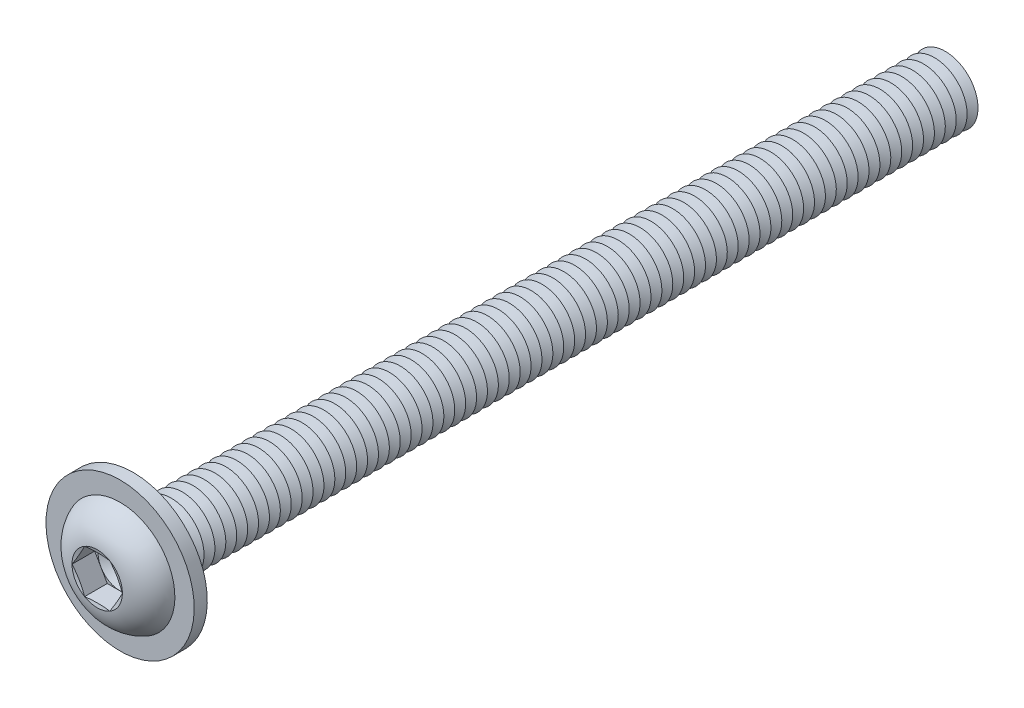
from build123d import *

# Parameters (mm, degrees)
FILLET1_R           = 0.5
LPATTERN1_COUNT     = 75
LPATTERN1_PITCH     = 1
CUT_EXTRUDE1_DEPTH  = 2.08
SKETCH5_R           = 6.8
SKETCH5_R_2         = 3.5
BOSS_EXTRUDE1_DEPTH = 1.2


with BuildPart() as part:
    # Sketch1 → Revolve1 (revolve)
    with BuildSketch(Plane(origin=(0, 0, 0), x_dir=(0, 0, -1), z_dir=(1, 0, 0))):
        with BuildLine():
            Line((0, 3), (0, 5.25))
            ThreePointArc((0, 5.25), (-2.210041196, 4.408189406), (-3.3, 2.3094))
            Line((-3.3, 2.3094), (-2.990599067, 1.1547))
            Line((-2.990599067, 1.1547), (-3.3, 1.1547))
            Line((-3.3, 1.1547), (-3.3, 0))
            Line((-3.3, 0), (75, 0))
            Line((75, 0), (75, 3))
            Line((75, 3), (0, 3))
        make_face()
    revolve(axis=Axis((0, 0, -75), (0, 0, 1)))

    # Fillet1
    fillet1_edges = [part.edges().sort_by_distance(p)[0] for p in [
        (0, -3, 0),
    ]]
    fillet(fillet1_edges, radius=FILLET1_R)

    # Sketch2 → Cut-Revolve1 (revolve, cut)
    with BuildSketch(Plane(origin=(0, 0, 0), x_dir=(0, 0, -1), z_dir=(1, 0, 0))):
        Polygon((74.5, 3), (75.5, 3), (75, 2.133974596), align=None)
    cut_revolve1 = revolve(axis=Axis((0, 0, -75), (0, 0, -1)), mode=Mode.SUBTRACT)

    # LPattern1: Cut-Revolve1 ×75
    with Locations(*[(0, 0, i * LPATTERN1_PITCH) for i in range(1, LPATTERN1_COUNT)]):
        add(cut_revolve1, mode=Mode.SUBTRACT)

    # Sketch3 → Cut-Extrude1 (cut)
    with BuildSketch(Plane.XY.offset(3.3)):
        Polygon((1.1547, 1.999999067), (-1.1547, 1.999999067), (-2.3094, 0), (-1.1547, -1.999999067), (1.1547, -1.999999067), (2.3094, 0), align=None)
    extrude(amount=-CUT_EXTRUDE1_DEPTH, mode=Mode.SUBTRACT)

    # Cut-Extrude2 cone 1 section (on through the dimple's axis) → Cut-Extrude2 (revolve, cut)
    with BuildSketch(Plane(origin=(0, 0, 1.22), x_dir=(0, -1, 0), z_dir=(1, 0, 0))):
        Polygon((0, 0), (1.999999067, 0), (0, 1.1547), align=None)
    revolve(axis=Axis((0, 0, 1.22), (0, 0, -1)), mode=Mode.SUBTRACT)

    # Sketch5 → Boss-Extrude1 (add)
    with BuildSketch(Plane(origin=(0, 0, 0), x_dir=(-1, 0, 0), z_dir=(0, 0, -1))):
        with Locations(Location((0, 0, 0), (0, 0, 90))):
            Circle(SKETCH5_R)
        Circle(SKETCH5_R_2, mode=Mode.SUBTRACT)
    extrude(amount=-BOSS_EXTRUDE1_DEPTH)


solid = part.part
